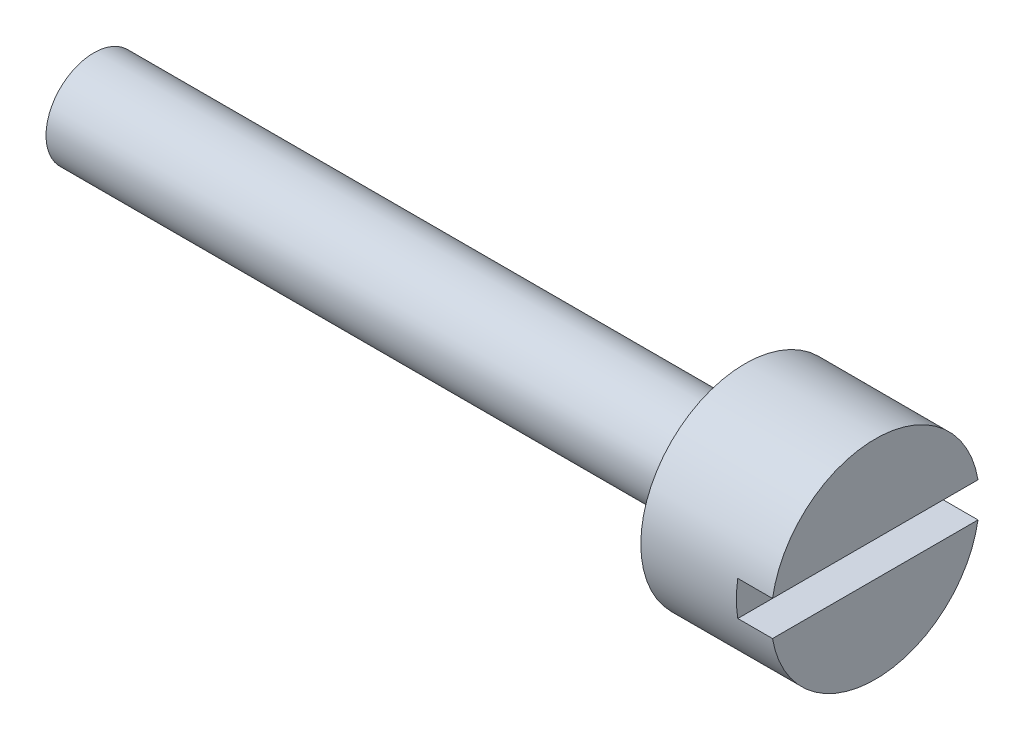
ISO-10303-21;
HEADER;
FILE_DESCRIPTION(('STEP AP214'),'2;1');
FILE_NAME('part.step','',(''),(''),'','','');
FILE_SCHEMA(('AUTOMOTIVE_DESIGN { 1 0 10303 214 1 1 1 1 }'));
ENDSEC;
DATA;
#1=APPLICATION_CONTEXT('core data for automotive mechanical design processes');
#2=APPLICATION_PROTOCOL_DEFINITION('international standard','automotive_design',2000,#1);
#3=PRODUCT_CONTEXT('',#1,'mechanical');
#4=PRODUCT('Part','Part','',(#3));
#5=PRODUCT_RELATED_PRODUCT_CATEGORY('part','',(#4));
#6=PRODUCT_DEFINITION_FORMATION('','',#4);
#7=PRODUCT_DEFINITION_CONTEXT('part definition',#1,'design');
#8=PRODUCT_DEFINITION('design','',#6,#7);
#9=PRODUCT_DEFINITION_SHAPE('','',#8);
#10=(LENGTH_UNIT() NAMED_UNIT(*) SI_UNIT(.MILLI.,.METRE.));
#11=(NAMED_UNIT(*) PLANE_ANGLE_UNIT() SI_UNIT($,.RADIAN.));
#12=(NAMED_UNIT(*) SI_UNIT($,.STERADIAN.) SOLID_ANGLE_UNIT());
#13=UNCERTAINTY_MEASURE_WITH_UNIT(LENGTH_MEASURE(1.E-05),#10,'distance_accuracy_value','');
#14=(GEOMETRIC_REPRESENTATION_CONTEXT(3) GLOBAL_UNCERTAINTY_ASSIGNED_CONTEXT((#13)) GLOBAL_UNIT_ASSIGNED_CONTEXT((#10,
#11,#12)) REPRESENTATION_CONTEXT('',''));
#15=CARTESIAN_POINT('',(0.,0.,0.));
#16=DIRECTION('',(0.,0.,1.));
#17=DIRECTION('',(1.,0.,0.));
#18=AXIS2_PLACEMENT_3D('',#15,#16,#17);
#19=CARTESIAN_POINT('',(-11.43,-0.126999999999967,0.));
#20=DIRECTION('',(1.,0.,0.));
#21=DIRECTION('',(0.,0.,-1.));
#22=AXIS2_PLACEMENT_3D('',#19,#20,#21);
#23=PLANE('',#22);
#24=CARTESIAN_POINT('',(-11.43,0.,0.));
#25=DIRECTION('',(-1.,0.,0.));
#26=DIRECTION('',(0.,0.,1.));
#27=AXIS2_PLACEMENT_3D('',#24,#25,#26);
#28=CIRCLE('',#27,1.397);
#29=CARTESIAN_POINT('',(-11.43,0.,1.397));
#30=VERTEX_POINT('',#29);
#31=EDGE_CURVE('E20',#30,#30,#28,.F.);
#32=ORIENTED_EDGE('',*,*,#31,.F.);
#33=EDGE_LOOP('',(#32));
#34=FACE_BOUND('',#33,.T.);
#35=ADVANCED_FACE('F16',(#34),#23,.F.);
#36=CARTESIAN_POINT('',(7.61999999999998,0.,0.));
#37=DIRECTION('',(-1.,0.,0.));
#38=DIRECTION('',(0.,0.,1.));
#39=AXIS2_PLACEMENT_3D('',#36,#37,#38);
#40=CYLINDRICAL_SURFACE('',#39,1.397);
#41=ORIENTED_EDGE('',*,*,#31,.T.);
#42=EDGE_LOOP('',(#41));
#43=FACE_BOUND('',#42,.T.);
#44=CARTESIAN_POINT('',(7.61999999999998,0.,0.));
#45=DIRECTION('',(-1.,0.,0.));
#46=DIRECTION('',(0.,0.,1.));
#47=AXIS2_PLACEMENT_3D('',#44,#45,#46);
#48=CIRCLE('',#47,1.397);
#49=CARTESIAN_POINT('',(7.61999999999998,0.,1.397));
#50=VERTEX_POINT('',#49);
#51=EDGE_CURVE('E83',#50,#50,#48,.T.);
#52=ORIENTED_EDGE('',*,*,#51,.T.);
#53=EDGE_LOOP('',(#52));
#54=FACE_BOUND('',#53,.T.);
#55=ADVANCED_FACE('F95',(#43,#54),#40,.T.);
#56=CARTESIAN_POINT('',(7.61999999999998,-0.277090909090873,0.));
#57=DIRECTION('',(1.,0.,0.));
#58=DIRECTION('',(0.,0.,-1.));
#59=AXIS2_PLACEMENT_3D('',#56,#57,#58);
#60=PLANE('',#59);
#61=ORIENTED_EDGE('',*,*,#51,.F.);
#62=EDGE_LOOP('',(#61));
#63=FACE_BOUND('',#62,.T.);
#64=CARTESIAN_POINT('',(7.61999999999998,0.,0.));
#65=DIRECTION('',(1.,0.,0.));
#66=DIRECTION('',(0.,0.,-1.));
#67=AXIS2_PLACEMENT_3D('',#64,#65,#66);
#68=CIRCLE('',#67,3.048);
#69=CARTESIAN_POINT('',(7.61999999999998,0.,-3.048));
#70=VERTEX_POINT('',#69);
#71=EDGE_CURVE('E71',#70,#70,#68,.T.);
#72=ORIENTED_EDGE('',*,*,#71,.F.);
#73=EDGE_LOOP('',(#72));
#74=FACE_BOUND('',#73,.T.);
#75=ADVANCED_FACE('F103',(#63,#74),#60,.F.);
#76=CARTESIAN_POINT('',(11.43,-0.277090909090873,0.));
#77=DIRECTION('',(1.,0.,0.));
#78=DIRECTION('',(0.,0.,-1.));
#79=AXIS2_PLACEMENT_3D('',#76,#77,#78);
#80=PLANE('',#79);
#81=CARTESIAN_POINT('',(11.43,0.,0.));
#82=DIRECTION('',(1.,0.,0.));
#83=DIRECTION('',(0.,0.,-1.));
#84=AXIS2_PLACEMENT_3D('',#81,#82,#83);
#85=CIRCLE('',#84,3.048);
#86=CARTESIAN_POINT('',(11.43,0.507999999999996,3.00536852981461));
#87=VERTEX_POINT('',#86);
#88=CARTESIAN_POINT('',(11.43,0.507999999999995,-3.00536852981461));
#89=VERTEX_POINT('',#88);
#90=EDGE_CURVE('E79',#87,#89,#85,.F.);
#91=ORIENTED_EDGE('',*,*,#90,.F.);
#92=DIRECTION('',(0.,0.,1.));
#93=VECTOR('',#92,1.);
#94=CARTESIAN_POINT('',(11.43,0.507999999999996,3.048));
#95=LINE('',#94,#93);
#96=EDGE_CURVE('E80',#87,#89,#95,.F.);
#97=ORIENTED_EDGE('',*,*,#96,.T.);
#98=EDGE_LOOP('',(#91,#97));
#99=FACE_BOUND('',#98,.T.);
#100=ADVANCED_FACE('F115',(#99),#80,.T.);
#101=CARTESIAN_POINT('',(10.414,0.507999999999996,3.048));
#102=DIRECTION('',(0.,1.,0.));
#103=DIRECTION('',(0.,0.,1.));
#104=AXIS2_PLACEMENT_3D('',#101,#102,#103);
#105=PLANE('',#104);
#106=ORIENTED_EDGE('',*,*,#96,.F.);
#107=DIRECTION('',(1.,0.,0.));
#108=VECTOR('',#107,1.);
#109=CARTESIAN_POINT('',(10.414,0.507999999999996,3.00536852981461));
#110=LINE('',#109,#108);
#111=CARTESIAN_POINT('',(10.414,0.507999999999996,3.00536852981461));
#112=VERTEX_POINT('',#111);
#113=EDGE_CURVE('E81',#112,#87,#110,.T.);
#114=ORIENTED_EDGE('',*,*,#113,.F.);
#115=DIRECTION('',(0.,0.,-1.));
#116=VECTOR('',#115,1.);
#117=CARTESIAN_POINT('',(10.414,0.507999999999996,0.));
#118=LINE('',#117,#116);
#119=CARTESIAN_POINT('',(10.414,0.507999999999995,-3.0053685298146));
#120=VERTEX_POINT('',#119);
#121=EDGE_CURVE('E66',#120,#112,#118,.F.);
#122=ORIENTED_EDGE('',*,*,#121,.F.);
#123=DIRECTION('',(1.,0.,0.));
#124=VECTOR('',#123,1.);
#125=CARTESIAN_POINT('',(7.61999999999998,0.507999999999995,-3.0053685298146));
#126=LINE('',#125,#124);
#127=EDGE_CURVE('E75',#89,#120,#126,.F.);
#128=ORIENTED_EDGE('',*,*,#127,.F.);
#129=EDGE_LOOP('',(#106,#114,#122,#128));
#130=FACE_BOUND('',#129,.T.);
#131=ADVANCED_FACE('F121',(#130),#105,.F.);
#132=CARTESIAN_POINT('',(10.414,0.,0.));
#133=DIRECTION('',(1.,0.,0.));
#134=DIRECTION('',(0.,0.,-1.));
#135=AXIS2_PLACEMENT_3D('',#132,#133,#134);
#136=PLANE('',#135);
#137=CARTESIAN_POINT('',(10.414,0.,0.));
#138=DIRECTION('',(1.,0.,0.));
#139=DIRECTION('',(0.,0.,-1.));
#140=AXIS2_PLACEMENT_3D('',#137,#138,#139);
#141=CIRCLE('',#140,3.048);
#142=CARTESIAN_POINT('',(10.414,-0.507999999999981,3.00536852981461));
#143=VERTEX_POINT('',#142);
#144=EDGE_CURVE('E58',#112,#143,#141,.T.);
#145=ORIENTED_EDGE('',*,*,#144,.T.);
#146=DIRECTION('',(0.,0.,-1.));
#147=VECTOR('',#146,1.);
#148=CARTESIAN_POINT('',(10.414,-0.507999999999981,-3.048));
#149=LINE('',#148,#147);
#150=CARTESIAN_POINT('',(10.414,-0.507999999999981,-3.00536852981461));
#151=VERTEX_POINT('',#150);
#152=EDGE_CURVE('E61',#143,#151,#149,.T.);
#153=ORIENTED_EDGE('',*,*,#152,.T.);
#154=CARTESIAN_POINT('',(10.414,0.,0.));
#155=DIRECTION('',(1.,0.,0.));
#156=DIRECTION('',(0.,0.,-1.));
#157=AXIS2_PLACEMENT_3D('',#154,#155,#156);
#158=CIRCLE('',#157,3.048);
#159=EDGE_CURVE('E78',#120,#151,#158,.F.);
#160=ORIENTED_EDGE('',*,*,#159,.F.);
#161=ORIENTED_EDGE('',*,*,#121,.T.);
#162=EDGE_LOOP('',(#145,#153,#160,#161));
#163=FACE_BOUND('',#162,.T.);
#164=ADVANCED_FACE('F64',(#163),#136,.T.);
#165=CARTESIAN_POINT('',(10.414,-0.507999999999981,-3.048));
#166=DIRECTION('',(0.,-1.,0.));
#167=DIRECTION('',(0.,0.,-1.));
#168=AXIS2_PLACEMENT_3D('',#165,#166,#167);
#169=PLANE('',#168);
#170=ORIENTED_EDGE('',*,*,#152,.F.);
#171=DIRECTION('',(1.,0.,0.));
#172=VECTOR('',#171,1.);
#173=CARTESIAN_POINT('',(10.414,-0.507999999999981,3.00536852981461));
#174=LINE('',#173,#172);
#175=CARTESIAN_POINT('',(11.43,-0.507999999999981,3.00536852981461));
#176=VERTEX_POINT('',#175);
#177=EDGE_CURVE('E54',#176,#143,#174,.F.);
#178=ORIENTED_EDGE('',*,*,#177,.F.);
#179=DIRECTION('',(0.,0.,-1.));
#180=VECTOR('',#179,1.);
#181=CARTESIAN_POINT('',(11.43,-0.507999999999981,0.));
#182=LINE('',#181,#180);
#183=CARTESIAN_POINT('',(11.43,-0.507999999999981,-3.00536852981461));
#184=VERTEX_POINT('',#183);
#185=EDGE_CURVE('E35',#184,#176,#182,.F.);
#186=ORIENTED_EDGE('',*,*,#185,.F.);
#187=DIRECTION('',(1.,0.,0.));
#188=VECTOR('',#187,1.);
#189=CARTESIAN_POINT('',(7.61999999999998,-0.507999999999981,-3.00536852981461));
#190=LINE('',#189,#188);
#191=EDGE_CURVE('E26',#151,#184,#190,.T.);
#192=ORIENTED_EDGE('',*,*,#191,.F.);
#193=EDGE_LOOP('',(#170,#178,#186,#192));
#194=FACE_BOUND('',#193,.T.);
#195=ADVANCED_FACE('F68',(#194),#169,.F.);
#196=CARTESIAN_POINT('',(11.43,-0.277090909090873,0.));
#197=DIRECTION('',(1.,0.,0.));
#198=DIRECTION('',(0.,0.,-1.));
#199=AXIS2_PLACEMENT_3D('',#196,#197,#198);
#200=PLANE('',#199);
#201=ORIENTED_EDGE('',*,*,#185,.T.);
#202=CARTESIAN_POINT('',(11.43,0.,0.));
#203=DIRECTION('',(1.,0.,0.));
#204=DIRECTION('',(0.,0.,-1.));
#205=AXIS2_PLACEMENT_3D('',#202,#203,#204);
#206=CIRCLE('',#205,3.048);
#207=EDGE_CURVE('E11',#184,#176,#206,.F.);
#208=ORIENTED_EDGE('',*,*,#207,.F.);
#209=EDGE_LOOP('',(#201,#208));
#210=FACE_BOUND('',#209,.T.);
#211=ADVANCED_FACE('F106',(#210),#200,.T.);
#212=CARTESIAN_POINT('',(7.61999999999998,0.,0.));
#213=DIRECTION('',(1.,0.,0.));
#214=DIRECTION('',(0.,0.,-1.));
#215=AXIS2_PLACEMENT_3D('',#212,#213,#214);
#216=CYLINDRICAL_SURFACE('',#215,3.048);
#217=ORIENTED_EDGE('',*,*,#71,.T.);
#218=EDGE_LOOP('',(#217));
#219=FACE_BOUND('',#218,.T.);
#220=ORIENTED_EDGE('',*,*,#191,.T.);
#221=ORIENTED_EDGE('',*,*,#207,.T.);
#222=ORIENTED_EDGE('',*,*,#177,.T.);
#223=ORIENTED_EDGE('',*,*,#144,.F.);
#224=ORIENTED_EDGE('',*,*,#113,.T.);
#225=ORIENTED_EDGE('',*,*,#90,.T.);
#226=ORIENTED_EDGE('',*,*,#127,.T.);
#227=ORIENTED_EDGE('',*,*,#159,.T.);
#228=EDGE_LOOP('',(#220,#221,#222,#223,#224,#225,#226,#227));
#229=FACE_BOUND('',#228,.T.);
#230=ADVANCED_FACE('F18',(#219,#229),#216,.T.);
#231=CLOSED_SHELL('',(#35,#55,#75,#100,#131,#164,#195,#211,#230));
#232=MANIFOLD_SOLID_BREP('B1',#231);
#233=ADVANCED_BREP_SHAPE_REPRESENTATION('',(#18,#232),#14);
#234=SHAPE_DEFINITION_REPRESENTATION(#9,#233);
ENDSEC;
END-ISO-10303-21;
